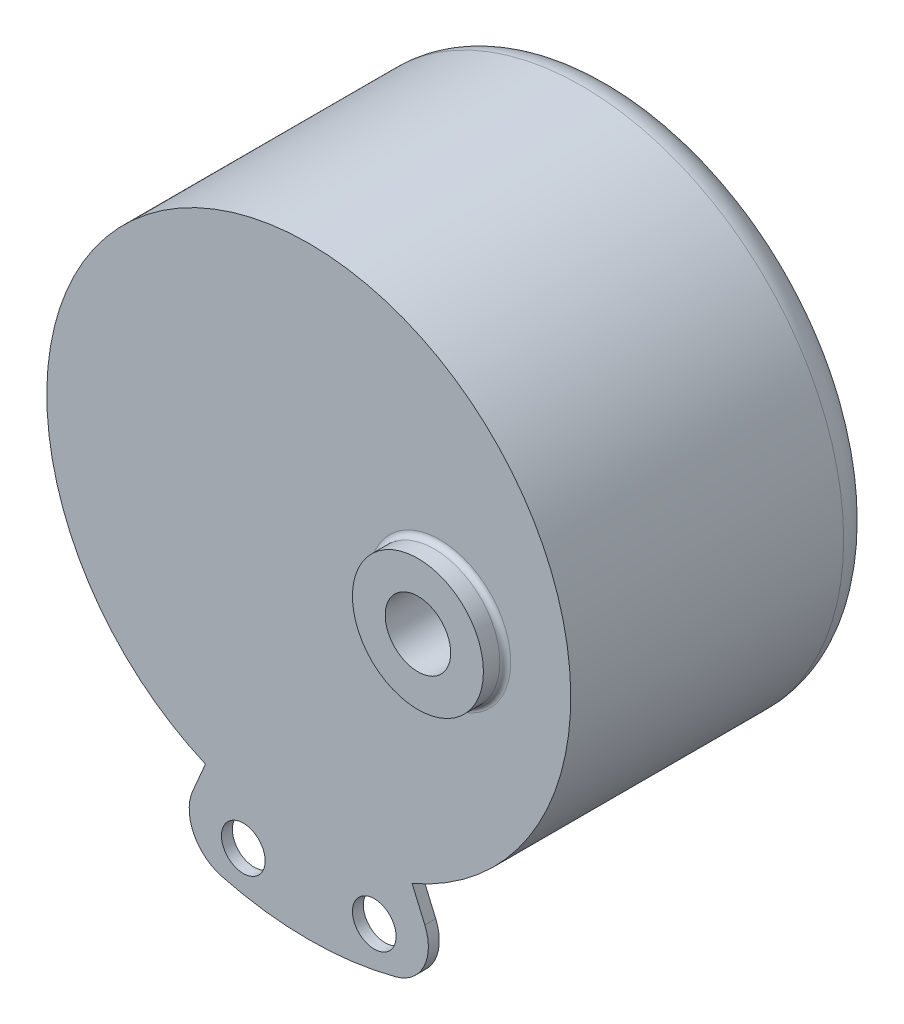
ISO-10303-21;
HEADER;
FILE_DESCRIPTION(('STEP AP214'),'2;1');
FILE_NAME('part.step','',(''),(''),'','','');
FILE_SCHEMA(('AUTOMOTIVE_DESIGN { 1 0 10303 214 1 1 1 1 }'));
ENDSEC;
DATA;
#1=APPLICATION_CONTEXT('core data for automotive mechanical design processes');
#2=APPLICATION_PROTOCOL_DEFINITION('international standard','automotive_design',2000,#1);
#3=PRODUCT_CONTEXT('',#1,'mechanical');
#4=PRODUCT('Part','Part','',(#3));
#5=PRODUCT_RELATED_PRODUCT_CATEGORY('part','',(#4));
#6=PRODUCT_DEFINITION_FORMATION('','',#4);
#7=PRODUCT_DEFINITION_CONTEXT('part definition',#1,'design');
#8=PRODUCT_DEFINITION('design','',#6,#7);
#9=PRODUCT_DEFINITION_SHAPE('','',#8);
#10=(LENGTH_UNIT() NAMED_UNIT(*) SI_UNIT(.MILLI.,.METRE.));
#11=(NAMED_UNIT(*) PLANE_ANGLE_UNIT() SI_UNIT($,.RADIAN.));
#12=(NAMED_UNIT(*) SI_UNIT($,.STERADIAN.) SOLID_ANGLE_UNIT());
#13=UNCERTAINTY_MEASURE_WITH_UNIT(LENGTH_MEASURE(1.E-05),#10,'distance_accuracy_value','');
#14=(GEOMETRIC_REPRESENTATION_CONTEXT(3) GLOBAL_UNCERTAINTY_ASSIGNED_CONTEXT((#13)) GLOBAL_UNIT_ASSIGNED_CONTEXT((#10,
#11,#12)) REPRESENTATION_CONTEXT('',''));
#15=CARTESIAN_POINT('',(0.,0.,0.));
#16=DIRECTION('',(0.,0.,1.));
#17=DIRECTION('',(1.,0.,0.));
#18=AXIS2_PLACEMENT_3D('',#15,#16,#17);
#19=CARTESIAN_POINT('',(0.,0.,28.));
#20=DIRECTION('',(0.,0.,1.));
#21=DIRECTION('',(1.,0.,0.));
#22=AXIS2_PLACEMENT_3D('',#19,#20,#21);
#23=PLANE('',#22);
#24=CARTESIAN_POINT('',(12.,0.,28.));
#25=DIRECTION('',(0.,0.,1.));
#26=DIRECTION('',(1.,0.,0.));
#27=AXIS2_PLACEMENT_3D('',#24,#25,#26);
#28=CIRCLE('',#27,6.5);
#29=CARTESIAN_POINT('',(18.5,0.,28.));
#30=VERTEX_POINT('',#29);
#31=EDGE_CURVE('E11',#30,#30,#28,.F.);
#32=ORIENTED_EDGE('',*,*,#31,.T.);
#33=EDGE_LOOP('',(#32));
#34=FACE_BOUND('',#33,.T.);
#35=CARTESIAN_POINT('',(0.,0.,28.));
#36=DIRECTION('',(0.,0.,1.));
#37=DIRECTION('',(1.,0.,0.));
#38=AXIS2_PLACEMENT_3D('',#35,#36,#37);
#39=CIRCLE('',#38,24.);
#40=CARTESIAN_POINT('',(9.46658806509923,-22.0541086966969,28.));
#41=VERTEX_POINT('',#40);
#42=CARTESIAN_POINT('',(-9.46658806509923,-22.0541086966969,28.));
#43=VERTEX_POINT('',#42);
#44=EDGE_CURVE('E148',#41,#43,#39,.T.);
#45=ORIENTED_EDGE('',*,*,#44,.T.);
#46=DIRECTION('',(-0.394441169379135,-0.918921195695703,0.));
#47=VECTOR('',#46,1.);
#48=CARTESIAN_POINT('',(-9.46658806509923,-22.0541086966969,28.));
#49=LINE('',#48,#47);
#50=CARTESIAN_POINT('',(-10.6308039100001,-24.7663575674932,28.));
#51=VERTEX_POINT('',#50);
#52=EDGE_CURVE('E121',#43,#51,#49,.T.);
#53=ORIENTED_EDGE('',*,*,#52,.T.);
#54=CARTESIAN_POINT('',(-6.95511912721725,-26.3441222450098,28.));
#55=DIRECTION('',(0.,0.,1.));
#56=DIRECTION('',(-1.,0.,0.));
#57=AXIS2_PLACEMENT_3D('',#54,#55,#56);
#58=CIRCLE('',#57,4.);
#59=CARTESIAN_POINT('',(-7.97617508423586,-30.2116078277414,28.));
#60=VERTEX_POINT('',#59);
#61=EDGE_CURVE('E124',#51,#60,#58,.T.);
#62=ORIENTED_EDGE('',*,*,#61,.T.);
#63=CARTESIAN_POINT('',(0.,0.,28.));
#64=DIRECTION('',(0.,0.,1.));
#65=DIRECTION('',(1.,0.,0.));
#66=AXIS2_PLACEMENT_3D('',#63,#64,#65);
#67=CIRCLE('',#66,31.2467696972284);
#68=CARTESIAN_POINT('',(7.97617508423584,-30.2116078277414,28.));
#69=VERTEX_POINT('',#68);
#70=EDGE_CURVE('E128',#60,#69,#67,.T.);
#71=ORIENTED_EDGE('',*,*,#70,.T.);
#72=CARTESIAN_POINT('',(6.95511912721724,-26.3441222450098,28.));
#73=DIRECTION('',(0.,0.,1.));
#74=DIRECTION('',(1.,0.,0.));
#75=AXIS2_PLACEMENT_3D('',#72,#73,#74);
#76=CIRCLE('',#75,4.);
#77=CARTESIAN_POINT('',(10.6308039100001,-24.7663575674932,28.));
#78=VERTEX_POINT('',#77);
#79=EDGE_CURVE('E99',#69,#78,#76,.T.);
#80=ORIENTED_EDGE('',*,*,#79,.T.);
#81=DIRECTION('',(-0.394441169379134,0.918921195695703,0.));
#82=VECTOR('',#81,1.);
#83=CARTESIAN_POINT('',(9.46658806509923,-22.0541086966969,28.));
#84=LINE('',#83,#82);
#85=EDGE_CURVE('E48',#78,#41,#84,.T.);
#86=ORIENTED_EDGE('',*,*,#85,.T.);
#87=EDGE_LOOP('',(#45,#53,#62,#71,#80,#86));
#88=FACE_BOUND('',#87,.T.);
#89=CARTESIAN_POINT('',(-6.,-27.,28.));
#90=DIRECTION('',(0.,0.,1.));
#91=DIRECTION('',(-1.,0.,0.));
#92=AXIS2_PLACEMENT_3D('',#89,#90,#91);
#93=CIRCLE('',#92,2.);
#94=CARTESIAN_POINT('',(-8.,-27.,28.));
#95=VERTEX_POINT('',#94);
#96=EDGE_CURVE('E242',#95,#95,#93,.T.);
#97=ORIENTED_EDGE('',*,*,#96,.F.);
#98=EDGE_LOOP('',(#97));
#99=FACE_BOUND('',#98,.T.);
#100=CARTESIAN_POINT('',(6.,-27.,28.));
#101=DIRECTION('',(0.,0.,1.));
#102=DIRECTION('',(1.,0.,0.));
#103=AXIS2_PLACEMENT_3D('',#100,#101,#102);
#104=CIRCLE('',#103,2.);
#105=CARTESIAN_POINT('',(8.,-27.,28.));
#106=VERTEX_POINT('',#105);
#107=EDGE_CURVE('E245',#106,#106,#104,.T.);
#108=ORIENTED_EDGE('',*,*,#107,.F.);
#109=EDGE_LOOP('',(#108));
#110=FACE_BOUND('',#109,.T.);
#111=ADVANCED_FACE('F33',(#34,#88,#99,#110),#23,.T.);
#112=CARTESIAN_POINT('',(0.,0.,28.));
#113=DIRECTION('',(0.,0.,-1.));
#114=DIRECTION('',(-1.,0.,0.));
#115=AXIS2_PLACEMENT_3D('',#112,#113,#114);
#116=CYLINDRICAL_SURFACE('',#115,24.);
#117=ORIENTED_EDGE('',*,*,#44,.F.);
#118=DIRECTION('',(0.,0.,1.));
#119=VECTOR('',#118,1.);
#120=CARTESIAN_POINT('',(9.46658806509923,-22.0541086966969,27.));
#121=LINE('',#120,#119);
#122=CARTESIAN_POINT('',(9.46658806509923,-22.0541086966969,27.));
#123=VERTEX_POINT('',#122);
#124=EDGE_CURVE('E132',#123,#41,#121,.T.);
#125=ORIENTED_EDGE('',*,*,#124,.F.);
#126=CARTESIAN_POINT('',(0.,0.,27.));
#127=DIRECTION('',(0.,0.,-1.));
#128=DIRECTION('',(1.,0.,0.));
#129=AXIS2_PLACEMENT_3D('',#126,#127,#128);
#130=CIRCLE('',#129,24.);
#131=CARTESIAN_POINT('',(-9.46658806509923,-22.0541086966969,27.));
#132=VERTEX_POINT('',#131);
#133=EDGE_CURVE('E57',#123,#132,#130,.T.);
#134=ORIENTED_EDGE('',*,*,#133,.T.);
#135=DIRECTION('',(0.,0.,1.));
#136=VECTOR('',#135,1.);
#137=CARTESIAN_POINT('',(-9.46658806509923,-22.0541086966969,27.));
#138=LINE('',#137,#136);
#139=EDGE_CURVE('E88',#132,#43,#138,.T.);
#140=ORIENTED_EDGE('',*,*,#139,.T.);
#141=EDGE_LOOP('',(#117,#125,#134,#140));
#142=FACE_BOUND('',#141,.T.);
#143=CARTESIAN_POINT('',(0.,0.,3.));
#144=DIRECTION('',(0.,0.,1.));
#145=DIRECTION('',(1.,0.,0.));
#146=AXIS2_PLACEMENT_3D('',#143,#144,#145);
#147=CIRCLE('',#146,24.);
#148=CARTESIAN_POINT('',(24.,0.,3.));
#149=VERTEX_POINT('',#148);
#150=EDGE_CURVE('E150',#149,#149,#147,.T.);
#151=ORIENTED_EDGE('',*,*,#150,.T.);
#152=EDGE_LOOP('',(#151));
#153=FACE_BOUND('',#152,.T.);
#154=ADVANCED_FACE('F176',(#142,#153),#116,.T.);
#155=CARTESIAN_POINT('',(0.,0.,0.));
#156=DIRECTION('',(0.,0.,1.));
#157=DIRECTION('',(1.,0.,0.));
#158=AXIS2_PLACEMENT_3D('',#155,#156,#157);
#159=PLANE('',#158);
#160=CARTESIAN_POINT('',(0.,0.,0.));
#161=DIRECTION('',(0.,0.,1.));
#162=DIRECTION('',(1.,0.,0.));
#163=AXIS2_PLACEMENT_3D('',#160,#161,#162);
#164=CIRCLE('',#163,21.);
#165=CARTESIAN_POINT('',(21.,0.,0.));
#166=VERTEX_POINT('',#165);
#167=EDGE_CURVE('E153',#166,#166,#164,.F.);
#168=ORIENTED_EDGE('',*,*,#167,.T.);
#169=EDGE_LOOP('',(#168));
#170=FACE_BOUND('',#169,.T.);
#171=ADVANCED_FACE('F182',(#170),#159,.F.);
#172=CARTESIAN_POINT('',(12.,0.,30.));
#173=DIRECTION('',(0.,0.,-1.));
#174=DIRECTION('',(-1.,0.,0.));
#175=AXIS2_PLACEMENT_3D('',#172,#173,#174);
#176=CYLINDRICAL_SURFACE('',#175,6.);
#177=CARTESIAN_POINT('',(12.,0.,28.5));
#178=DIRECTION('',(0.,0.,1.));
#179=DIRECTION('',(1.,0.,0.));
#180=AXIS2_PLACEMENT_3D('',#177,#178,#179);
#181=CIRCLE('',#180,6.);
#182=CARTESIAN_POINT('',(18.,0.,28.5));
#183=VERTEX_POINT('',#182);
#184=EDGE_CURVE('E41',#183,#183,#181,.T.);
#185=ORIENTED_EDGE('',*,*,#184,.T.);
#186=EDGE_LOOP('',(#185));
#187=FACE_BOUND('',#186,.T.);
#188=CARTESIAN_POINT('',(12.,0.,30.));
#189=DIRECTION('',(0.,0.,1.));
#190=DIRECTION('',(1.,0.,0.));
#191=AXIS2_PLACEMENT_3D('',#188,#189,#190);
#192=CIRCLE('',#191,6.);
#193=CARTESIAN_POINT('',(18.,0.,30.));
#194=VERTEX_POINT('',#193);
#195=EDGE_CURVE('E143',#194,#194,#192,.T.);
#196=ORIENTED_EDGE('',*,*,#195,.F.);
#197=EDGE_LOOP('',(#196));
#198=FACE_BOUND('',#197,.T.);
#199=ADVANCED_FACE('F158',(#187,#198),#176,.T.);
#200=CARTESIAN_POINT('',(12.,0.,30.));
#201=DIRECTION('',(0.,0.,1.));
#202=DIRECTION('',(1.,0.,0.));
#203=AXIS2_PLACEMENT_3D('',#200,#201,#202);
#204=PLANE('',#203);
#205=CARTESIAN_POINT('',(12.,0.,30.));
#206=DIRECTION('',(0.,0.,1.));
#207=DIRECTION('',(1.,0.,0.));
#208=AXIS2_PLACEMENT_3D('',#205,#206,#207);
#209=CIRCLE('',#208,3.);
#210=CARTESIAN_POINT('',(15.,0.,30.));
#211=VERTEX_POINT('',#210);
#212=EDGE_CURVE('E134',#211,#211,#209,.T.);
#213=ORIENTED_EDGE('',*,*,#212,.F.);
#214=EDGE_LOOP('',(#213));
#215=FACE_BOUND('',#214,.T.);
#216=ORIENTED_EDGE('',*,*,#195,.T.);
#217=EDGE_LOOP('',(#216));
#218=FACE_BOUND('',#217,.T.);
#219=ADVANCED_FACE('F172',(#215,#218),#204,.T.);
#220=CARTESIAN_POINT('',(0.,0.,3.));
#221=DIRECTION('',(0.,0.,1.));
#222=DIRECTION('',(1.,0.,0.));
#223=AXIS2_PLACEMENT_3D('',#220,#221,#222);
#224=TOROIDAL_SURFACE('',#223,21.,3.);
#225=ORIENTED_EDGE('',*,*,#167,.F.);
#226=EDGE_LOOP('',(#225));
#227=FACE_BOUND('',#226,.T.);
#228=ORIENTED_EDGE('',*,*,#150,.F.);
#229=EDGE_LOOP('',(#228));
#230=FACE_BOUND('',#229,.T.);
#231=ADVANCED_FACE('F163',(#227,#230),#224,.T.);
#232=CARTESIAN_POINT('',(12.,0.,28.5));
#233=DIRECTION('',(0.,0.,1.));
#234=DIRECTION('',(1.,0.,0.));
#235=AXIS2_PLACEMENT_3D('',#232,#233,#234);
#236=TOROIDAL_SURFACE('',#235,6.5,0.5);
#237=ORIENTED_EDGE('',*,*,#31,.F.);
#238=EDGE_LOOP('',(#237));
#239=FACE_BOUND('',#238,.T.);
#240=ORIENTED_EDGE('',*,*,#184,.F.);
#241=EDGE_LOOP('',(#240));
#242=FACE_BOUND('',#241,.T.);
#243=ADVANCED_FACE('F35',(#239,#242),#236,.F.);
#244=CARTESIAN_POINT('',(12.,0.,20.));
#245=DIRECTION('',(0.,0.,1.));
#246=DIRECTION('',(1.,0.,0.));
#247=AXIS2_PLACEMENT_3D('',#244,#245,#246);
#248=CYLINDRICAL_SURFACE('',#247,3.);
#249=CARTESIAN_POINT('',(12.,0.,20.));
#250=DIRECTION('',(0.,0.,1.));
#251=DIRECTION('',(1.,0.,0.));
#252=AXIS2_PLACEMENT_3D('',#249,#250,#251);
#253=CIRCLE('',#252,3.);
#254=CARTESIAN_POINT('',(15.,0.,20.));
#255=VERTEX_POINT('',#254);
#256=EDGE_CURVE('E140',#255,#255,#253,.T.);
#257=ORIENTED_EDGE('',*,*,#256,.F.);
#258=EDGE_LOOP('',(#257));
#259=FACE_BOUND('',#258,.T.);
#260=ORIENTED_EDGE('',*,*,#212,.T.);
#261=EDGE_LOOP('',(#260));
#262=FACE_BOUND('',#261,.T.);
#263=ADVANCED_FACE('F162',(#259,#262),#248,.F.);
#264=CARTESIAN_POINT('',(12.,0.,20.));
#265=DIRECTION('',(0.,0.,1.));
#266=DIRECTION('',(1.,0.,0.));
#267=AXIS2_PLACEMENT_3D('',#264,#265,#266);
#268=PLANE('',#267);
#269=ORIENTED_EDGE('',*,*,#256,.T.);
#270=EDGE_LOOP('',(#269));
#271=FACE_BOUND('',#270,.T.);
#272=ADVANCED_FACE('F169',(#271),#268,.T.);
#273=CARTESIAN_POINT('',(9.46658806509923,-22.0541086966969,27.));
#274=DIRECTION('',(0.918921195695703,0.394441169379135,0.));
#275=DIRECTION('',(-0.394441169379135,0.918921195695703,0.));
#276=AXIS2_PLACEMENT_3D('',#273,#274,#275);
#277=PLANE('',#276);
#278=ORIENTED_EDGE('',*,*,#85,.F.);
#279=DIRECTION('',(0.,0.,1.));
#280=VECTOR('',#279,1.);
#281=CARTESIAN_POINT('',(10.6308039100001,-24.7663575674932,27.));
#282=LINE('',#281,#280);
#283=CARTESIAN_POINT('',(10.6308039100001,-24.7663575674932,27.));
#284=VERTEX_POINT('',#283);
#285=EDGE_CURVE('E81',#284,#78,#282,.T.);
#286=ORIENTED_EDGE('',*,*,#285,.F.);
#287=DIRECTION('',(-0.394441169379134,0.918921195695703,0.));
#288=VECTOR('',#287,1.);
#289=CARTESIAN_POINT('',(9.46658806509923,-22.0541086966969,27.));
#290=LINE('',#289,#288);
#291=EDGE_CURVE('E111',#284,#123,#290,.T.);
#292=ORIENTED_EDGE('',*,*,#291,.T.);
#293=ORIENTED_EDGE('',*,*,#124,.T.);
#294=EDGE_LOOP('',(#278,#286,#292,#293));
#295=FACE_BOUND('',#294,.T.);
#296=ADVANCED_FACE('F208',(#295),#277,.T.);
#297=CARTESIAN_POINT('',(6.95511912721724,-26.3441222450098,27.));
#298=DIRECTION('',(0.,0.,1.));
#299=DIRECTION('',(1.,0.,0.));
#300=AXIS2_PLACEMENT_3D('',#297,#298,#299);
#301=CYLINDRICAL_SURFACE('',#300,4.);
#302=ORIENTED_EDGE('',*,*,#79,.F.);
#303=DIRECTION('',(0.,0.,1.));
#304=VECTOR('',#303,1.);
#305=CARTESIAN_POINT('',(7.97617508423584,-30.2116078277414,27.));
#306=LINE('',#305,#304);
#307=CARTESIAN_POINT('',(7.97617508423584,-30.2116078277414,27.));
#308=VERTEX_POINT('',#307);
#309=EDGE_CURVE('E95',#308,#69,#306,.T.);
#310=ORIENTED_EDGE('',*,*,#309,.F.);
#311=CARTESIAN_POINT('',(6.95511912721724,-26.3441222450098,27.));
#312=DIRECTION('',(0.,0.,1.));
#313=DIRECTION('',(1.,0.,0.));
#314=AXIS2_PLACEMENT_3D('',#311,#312,#313);
#315=CIRCLE('',#314,4.);
#316=EDGE_CURVE('E98',#308,#284,#315,.T.);
#317=ORIENTED_EDGE('',*,*,#316,.T.);
#318=ORIENTED_EDGE('',*,*,#285,.T.);
#319=EDGE_LOOP('',(#302,#310,#317,#318));
#320=FACE_BOUND('',#319,.T.);
#321=ADVANCED_FACE('F97',(#320),#301,.T.);
#322=CARTESIAN_POINT('',(0.,0.,27.));
#323=DIRECTION('',(0.,0.,1.));
#324=DIRECTION('',(1.,0.,0.));
#325=AXIS2_PLACEMENT_3D('',#322,#323,#324);
#326=CYLINDRICAL_SURFACE('',#325,31.2467696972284);
#327=ORIENTED_EDGE('',*,*,#70,.F.);
#328=DIRECTION('',(0.,0.,1.));
#329=VECTOR('',#328,1.);
#330=CARTESIAN_POINT('',(-7.97617508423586,-30.2116078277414,27.));
#331=LINE('',#330,#329);
#332=CARTESIAN_POINT('',(-7.97617508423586,-30.2116078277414,27.));
#333=VERTEX_POINT('',#332);
#334=EDGE_CURVE('E104',#333,#60,#331,.T.);
#335=ORIENTED_EDGE('',*,*,#334,.F.);
#336=CARTESIAN_POINT('',(0.,0.,27.));
#337=DIRECTION('',(0.,0.,1.));
#338=DIRECTION('',(1.,0.,0.));
#339=AXIS2_PLACEMENT_3D('',#336,#337,#338);
#340=CIRCLE('',#339,31.2467696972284);
#341=EDGE_CURVE('E109',#333,#308,#340,.T.);
#342=ORIENTED_EDGE('',*,*,#341,.T.);
#343=ORIENTED_EDGE('',*,*,#309,.T.);
#344=EDGE_LOOP('',(#327,#335,#342,#343));
#345=FACE_BOUND('',#344,.T.);
#346=ADVANCED_FACE('F113',(#345),#326,.T.);
#347=CARTESIAN_POINT('',(-6.95511912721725,-26.3441222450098,27.));
#348=DIRECTION('',(0.,0.,1.));
#349=DIRECTION('',(1.,0.,0.));
#350=AXIS2_PLACEMENT_3D('',#347,#348,#349);
#351=CYLINDRICAL_SURFACE('',#350,4.);
#352=ORIENTED_EDGE('',*,*,#61,.F.);
#353=DIRECTION('',(0.,0.,1.));
#354=VECTOR('',#353,1.);
#355=CARTESIAN_POINT('',(-10.6308039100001,-24.7663575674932,27.));
#356=LINE('',#355,#354);
#357=CARTESIAN_POINT('',(-10.6308039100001,-24.7663575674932,27.));
#358=VERTEX_POINT('',#357);
#359=EDGE_CURVE('E137',#358,#51,#356,.T.);
#360=ORIENTED_EDGE('',*,*,#359,.F.);
#361=CARTESIAN_POINT('',(-6.95511912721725,-26.3441222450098,27.));
#362=DIRECTION('',(0.,0.,1.));
#363=DIRECTION('',(-1.,0.,0.));
#364=AXIS2_PLACEMENT_3D('',#361,#362,#363);
#365=CIRCLE('',#364,4.);
#366=EDGE_CURVE('E114',#358,#333,#365,.T.);
#367=ORIENTED_EDGE('',*,*,#366,.T.);
#368=ORIENTED_EDGE('',*,*,#334,.T.);
#369=EDGE_LOOP('',(#352,#360,#367,#368));
#370=FACE_BOUND('',#369,.T.);
#371=ADVANCED_FACE('F213',(#370),#351,.T.);
#372=CARTESIAN_POINT('',(-9.46658806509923,-22.0541086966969,27.));
#373=DIRECTION('',(-0.918921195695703,0.394441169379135,0.));
#374=DIRECTION('',(-0.394441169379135,-0.918921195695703,0.));
#375=AXIS2_PLACEMENT_3D('',#372,#373,#374);
#376=PLANE('',#375);
#377=ORIENTED_EDGE('',*,*,#52,.F.);
#378=ORIENTED_EDGE('',*,*,#139,.F.);
#379=DIRECTION('',(-0.394441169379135,-0.918921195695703,0.));
#380=VECTOR('',#379,1.);
#381=CARTESIAN_POINT('',(-9.46658806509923,-22.0541086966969,27.));
#382=LINE('',#381,#380);
#383=EDGE_CURVE('E116',#132,#358,#382,.T.);
#384=ORIENTED_EDGE('',*,*,#383,.T.);
#385=ORIENTED_EDGE('',*,*,#359,.T.);
#386=EDGE_LOOP('',(#377,#378,#384,#385));
#387=FACE_BOUND('',#386,.T.);
#388=ADVANCED_FACE('F210',(#387),#376,.T.);
#389=CARTESIAN_POINT('',(0.,0.,27.));
#390=DIRECTION('',(0.,0.,1.));
#391=DIRECTION('',(1.,0.,0.));
#392=AXIS2_PLACEMENT_3D('',#389,#390,#391);
#393=PLANE('',#392);
#394=CARTESIAN_POINT('',(-6.,-27.,27.));
#395=DIRECTION('',(0.,0.,1.));
#396=DIRECTION('',(-1.,0.,0.));
#397=AXIS2_PLACEMENT_3D('',#394,#395,#396);
#398=CIRCLE('',#397,2.);
#399=CARTESIAN_POINT('',(-8.,-27.,27.));
#400=VERTEX_POINT('',#399);
#401=EDGE_CURVE('E239',#400,#400,#398,.T.);
#402=ORIENTED_EDGE('',*,*,#401,.T.);
#403=EDGE_LOOP('',(#402));
#404=FACE_BOUND('',#403,.T.);
#405=CARTESIAN_POINT('',(6.,-27.,27.));
#406=DIRECTION('',(0.,0.,1.));
#407=DIRECTION('',(1.,0.,0.));
#408=AXIS2_PLACEMENT_3D('',#405,#406,#407);
#409=CIRCLE('',#408,2.);
#410=CARTESIAN_POINT('',(8.,-27.,27.));
#411=VERTEX_POINT('',#410);
#412=EDGE_CURVE('E125',#411,#411,#409,.T.);
#413=ORIENTED_EDGE('',*,*,#412,.T.);
#414=EDGE_LOOP('',(#413));
#415=FACE_BOUND('',#414,.T.);
#416=ORIENTED_EDGE('',*,*,#133,.F.);
#417=ORIENTED_EDGE('',*,*,#291,.F.);
#418=ORIENTED_EDGE('',*,*,#316,.F.);
#419=ORIENTED_EDGE('',*,*,#341,.F.);
#420=ORIENTED_EDGE('',*,*,#366,.F.);
#421=ORIENTED_EDGE('',*,*,#383,.F.);
#422=EDGE_LOOP('',(#416,#417,#418,#419,#420,#421));
#423=FACE_BOUND('',#422,.T.);
#424=ADVANCED_FACE('F107',(#404,#415,#423),#393,.F.);
#425=CARTESIAN_POINT('',(6.,-27.,27.));
#426=DIRECTION('',(0.,0.,1.));
#427=DIRECTION('',(1.,0.,0.));
#428=AXIS2_PLACEMENT_3D('',#425,#426,#427);
#429=CYLINDRICAL_SURFACE('',#428,2.);
#430=ORIENTED_EDGE('',*,*,#412,.F.);
#431=EDGE_LOOP('',(#430));
#432=FACE_BOUND('',#431,.T.);
#433=ORIENTED_EDGE('',*,*,#107,.T.);
#434=EDGE_LOOP('',(#433));
#435=FACE_BOUND('',#434,.T.);
#436=ADVANCED_FACE('F226',(#432,#435),#429,.F.);
#437=CARTESIAN_POINT('',(-6.,-27.,27.));
#438=DIRECTION('',(0.,0.,1.));
#439=DIRECTION('',(1.,0.,0.));
#440=AXIS2_PLACEMENT_3D('',#437,#438,#439);
#441=CYLINDRICAL_SURFACE('',#440,2.);
#442=ORIENTED_EDGE('',*,*,#401,.F.);
#443=EDGE_LOOP('',(#442));
#444=FACE_BOUND('',#443,.T.);
#445=ORIENTED_EDGE('',*,*,#96,.T.);
#446=EDGE_LOOP('',(#445));
#447=FACE_BOUND('',#446,.T.);
#448=ADVANCED_FACE('F230',(#444,#447),#441,.F.);
#449=CLOSED_SHELL('',(#111,#154,#171,#199,#219,#231,#243,#263,#272,#296,#321,#346,#371,#388,
#424,#436,#448));
#450=MANIFOLD_SOLID_BREP('B2',#449);
#451=ADVANCED_BREP_SHAPE_REPRESENTATION('',(#18,#450),#14);
#452=SHAPE_DEFINITION_REPRESENTATION(#9,#451);
ENDSEC;
END-ISO-10303-21;
